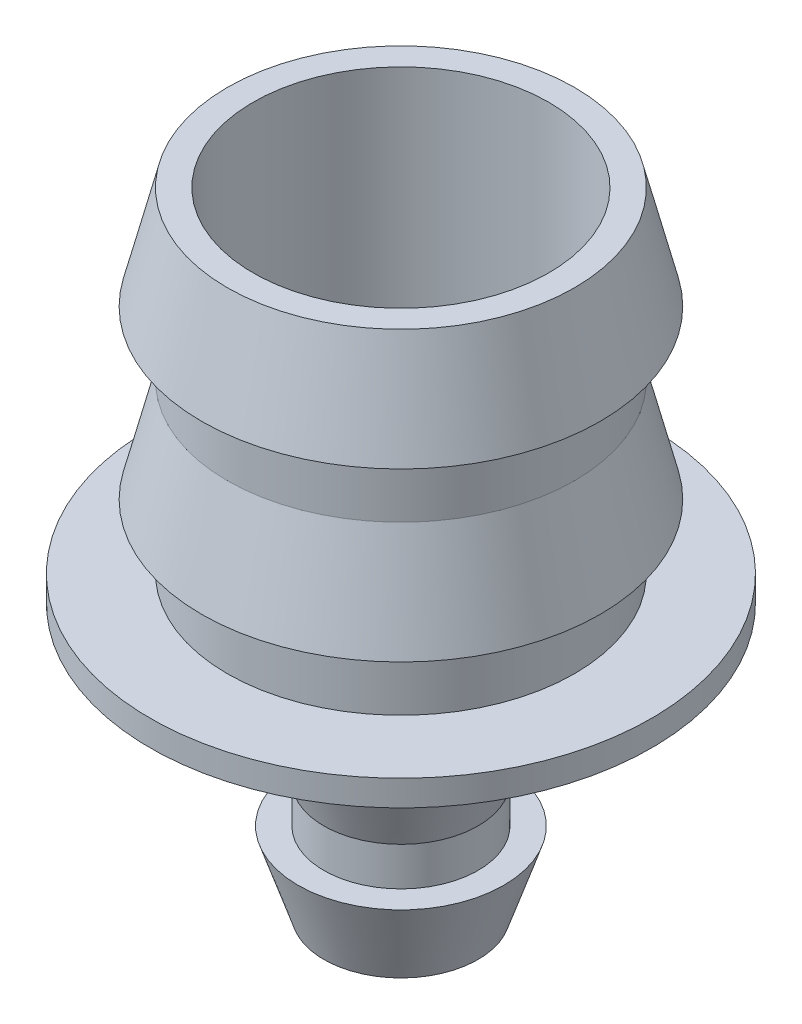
from build123d import *


with BuildPart() as part:
    # Sketch1 → Revolve1 (revolve)
    with BuildSketch(Plane.XY, mode=Mode.PRIVATE) as revolve1_sk:
        Polygon((-6.75, 10.5), (-7.75, 6.5), (-6.75, 6.5), (-6.75, 4), (-7.75, 0), (-6.75, 0), (-6.75, -2.5), (-9.75, -2.5), (-9.75, -3.5), (-6.75, -3.5), (-3, -4.5), (-3, -6.5), (-4, -6.5), (-3, -9.5), (-3, -11), (-4, -11), (-3, -14), (-2, -14), (-2, -3.5), (-5.75, -2.5), (-5.75, 10.5), align=None)
    revolve(revolve1_sk.sketch.rotate(Axis((0, 0, 0), (0, 1, 0)), 270), axis=Axis((0, 0, 0), (0, 1, 0)))


solid = part.part
